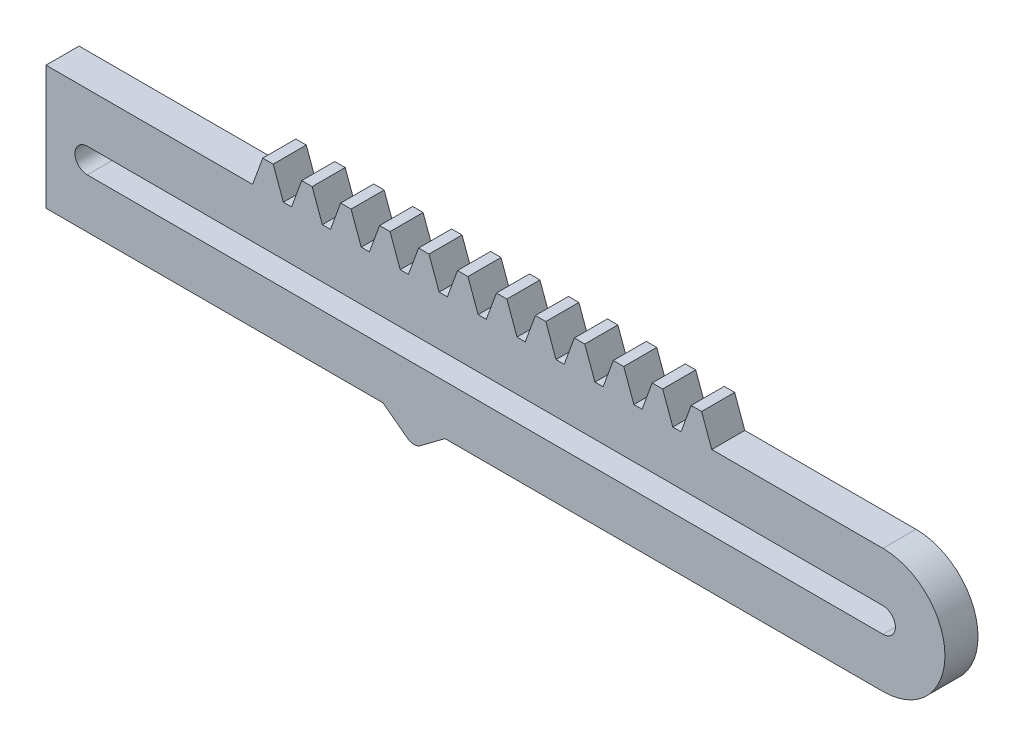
from build123d import *

# Parameters (mm, degrees)
BOSS_EXTRU_1_DEPTH = 8


with BuildPart() as part:
    # Esquisse1 → Boss.-Extru.1 (new body)
    with BuildSketch(Plane.XY):
        with BuildLine():
            Line((3.721082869, 15), (1.264283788, 21.75))
            Line((1.264283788, 21.75), (-1.264283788, 21.75))
            Line((-1.264283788, 21.75), (-3.721082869, 15))
            Line((-3.721082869, 15), (-53.721082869, 15))
            Line((-53.721082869, 15), (-53.721082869, -15))
            Line((-53.721082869, -15), (27.823144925, -15))
            Line((27.823144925, -15), (33.823144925, -19.5))
            ThreePointArc((33.823144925, -19.5), (35.323144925, -20), (36.823144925, -19.5))
            Line((36.823144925, -19.5), (42.823144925, -15))
            Line((42.823144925, -15), (148.823144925, -15))
            ThreePointArc((148.823144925, -15), (163.823144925, 0), (148.823144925, 15))
            Line((148.823144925, 15), (107.393640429, 15))
            Line((107.393640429, 15), (104.936841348, 21.75))
            Line((104.936841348, 21.75), (102.408273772, 21.75))
            Line((102.408273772, 21.75), (99.951474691, 15))
            Line((99.951474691, 15), (97.968862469, 15))
            Line((97.968862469, 15), (95.512063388, 21.75))
            Line((95.512063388, 21.75), (92.983495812, 21.75))
            Line((92.983495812, 21.75), (90.526696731, 15))
            Line((90.526696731, 15), (88.544084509, 15))
            Line((88.544084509, 15), (86.087285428, 21.75))
            Line((86.087285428, 21.75), (83.558717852, 21.75))
            Line((83.558717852, 21.75), (81.101918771, 15))
            Line((81.101918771, 15), (79.119306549, 15))
            Line((79.119306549, 15), (76.662507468, 21.75))
            Line((76.662507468, 21.75), (74.133939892, 21.75))
            Line((74.133939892, 21.75), (71.677140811, 15))
            Line((71.677140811, 15), (69.694528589, 15))
            Line((69.694528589, 15), (67.237729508, 21.75))
            Line((67.237729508, 21.75), (64.709161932, 21.75))
            Line((64.709161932, 21.75), (62.252362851, 15))
            Line((62.252362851, 15), (60.269750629, 15))
            Line((60.269750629, 15), (57.812951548, 21.75))
            Line((57.812951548, 21.75), (55.284383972, 21.75))
            Line((55.284383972, 21.75), (52.827584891, 15))
            Line((52.827584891, 15), (50.844972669, 15))
            Line((50.844972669, 15), (48.388173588, 21.75))
            Line((48.388173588, 21.75), (45.859606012, 21.75))
            Line((45.859606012, 21.75), (43.402806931, 15))
            Line((43.402806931, 15), (41.420194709, 15))
            Line((41.420194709, 15), (38.963395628, 21.75))
            Line((38.963395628, 21.75), (36.434828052, 21.75))
            Line((36.434828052, 21.75), (33.978028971, 15))
            Line((33.978028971, 15), (31.995416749, 15))
            Line((31.995416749, 15), (29.538617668, 21.75))
            Line((29.538617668, 21.75), (27.010050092, 21.75))
            Line((27.010050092, 21.75), (24.553251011, 15))
            Line((24.553251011, 15), (22.570638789, 15))
            Line((22.570638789, 15), (20.113839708, 21.75))
            Line((20.113839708, 21.75), (17.585272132, 21.75))
            Line((17.585272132, 21.75), (15.128473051, 15))
            Line((15.128473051, 15), (13.145860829, 15))
            Line((13.145860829, 15), (10.689061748, 21.75))
            Line((10.689061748, 21.75), (8.160494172, 21.75))
            Line((8.160494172, 21.75), (5.703695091, 15))
            Line((5.703695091, 15), (3.721082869, 15))
        make_face()
        with BuildLine():
            Line((-43.721082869, 3), (148.823144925, 3))
            ThreePointArc((148.823144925, 3), (151.823144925, 0), (148.823144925, -3))
            Line((148.823144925, -3), (-43.721082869, -3))
            ThreePointArc((-43.721082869, -3), (-46.721082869, 0), (-43.721082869, 3))
        make_face(mode=Mode.SUBTRACT)
    extrude(amount=BOSS_EXTRU_1_DEPTH)


solid = part.part
